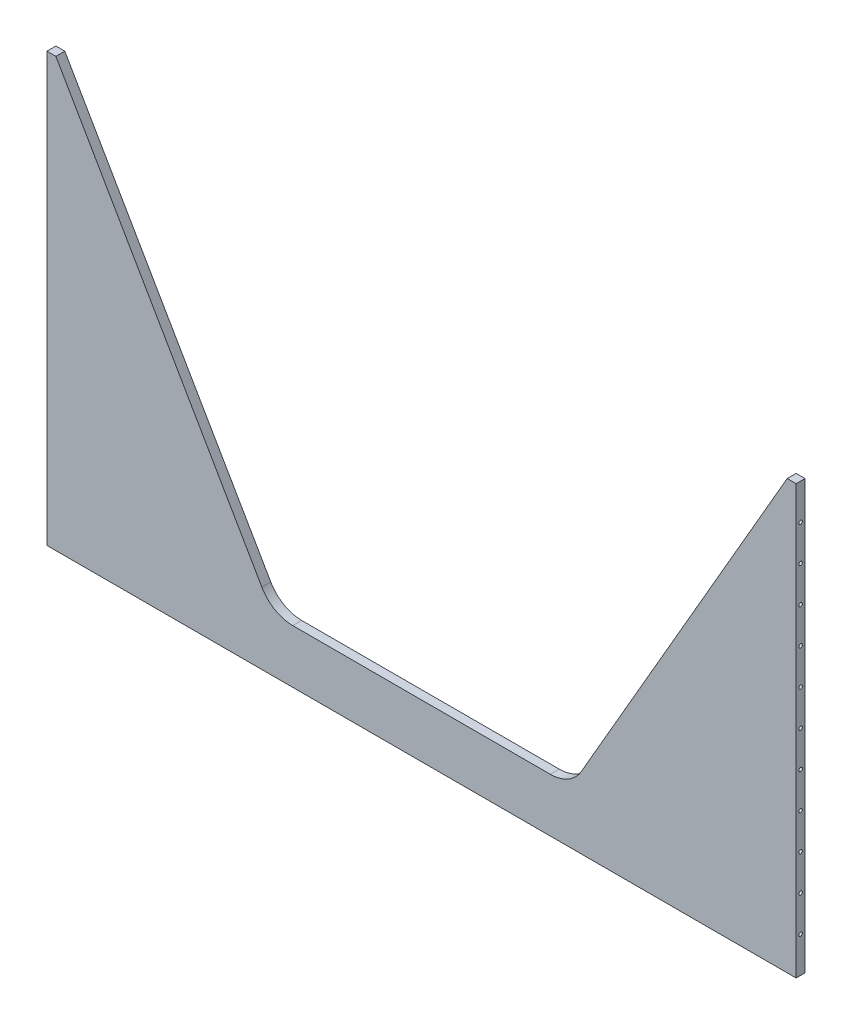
from build123d import *

# Parameters (mm, degrees)
SKETCH1_W           = 1066.8
SKETCH1_H           = 609.6
BOSS_EXTRUDE1_DEPTH = 12.7
CUT_EXTRUDE1_DEPTH  = 615.475296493
LPATTERN1_COUNT     = 11
LPATTERN1_PITCH     = 50.8
LPATTERN2_COUNT     = 20
LPATTERN2_PITCH     = 50.8


with BuildPart() as part:
    # Sketch1 → Boss-Extrude1 (new body)
    with BuildSketch(Plane.XY):
        Rectangle(SKETCH1_W, SKETCH1_H)
    extrude(amount=BOSS_EXTRUDE1_DEPTH)

    # Sketch2 → Cut-Extrude1 (cut, through all)
    with BuildSketch(Plane.XY.offset(12.7)):
        with BuildLine():
            Line((-520.7, 304.8), (-227.406063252, -203.2))
            ThreePointArc((-227.406063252, -203.2), (-208.811972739, -221.794090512), (-183.411972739, -228.6))
            Line((-183.411972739, -228.6), (183.411972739, -228.6))
            ThreePointArc((183.411972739, -228.6), (208.811972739, -221.794090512), (227.406063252, -203.2))
            Line((227.406063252, -203.2), (520.7, 304.8))
            Line((520.7, 304.8), (-520.7, 304.8))
        make_face()
    extrude(amount=-CUT_EXTRUDE1_DEPTH, mode=Mode.SUBTRACT)

    # Sketch3 → 1_4-20 Tapped Hole1 (revolve, cut)
    with BuildSketch(Plane(origin=(-533.4, -254, 6.35), x_dir=(0, 0, 1), z_dir=(0, 1, 0))):
        Polygon((0, 0), (0, 14.868816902), (2.5527, 13.335), (2.5527, 0), align=None)
    f_1_4_20_tapped_hole1 = revolve(axis=Axis((-539.75, -254, 6.35), (1, 0, 0)), mode=Mode.SUBTRACT)

    # LPattern1: 1_4-20 Tapped Hole1 ×11
    with Locations(*[(0, i * LPATTERN1_PITCH, 0) for i in range(1, LPATTERN1_COUNT)]):
        add(f_1_4_20_tapped_hole1, mode=Mode.SUBTRACT)

    # Mirror1: 1_4-20 Tapped Hole1 across plane
    add(f_1_4_20_tapped_hole1.mirror(Plane(origin=(0, 0, 0), x_dir=(0, 0, 1), z_dir=(1, 0, 0))), mode=Mode.SUBTRACT)

    # Mirror1 copy 1 sketch → Mirror1 copy 1 (revolve, cut)
    with BuildSketch(Plane(origin=(533.4, -203.2, 6.35), x_dir=(0, 0, 1), z_dir=(0, 1, 0))):
        Polygon((0, 0), (0, -14.868816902), (2.5527, -13.335), (2.5527, 0), align=None)
    revolve(axis=Axis((539.75, -203.2, 6.35), (1, 0, 0)), mode=Mode.SUBTRACT)

    # Mirror1 copy 2 sketch → Mirror1 copy 2 (revolve, cut)
    with BuildSketch(Plane(origin=(533.4, -152.4, 6.35), x_dir=(0, 0, 1), z_dir=(0, 1, 0))):
        Polygon((0, 0), (0, -14.868816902), (2.5527, -13.335), (2.5527, 0), align=None)
    revolve(axis=Axis((539.75, -152.4, 6.35), (1, 0, 0)), mode=Mode.SUBTRACT)

    # Mirror1 copy 3 sketch → Mirror1 copy 3 (revolve, cut)
    with BuildSketch(Plane(origin=(533.4, -101.6, 6.35), x_dir=(0, 0, 1), z_dir=(0, 1, 0))):
        Polygon((0, 0), (0, -14.868816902), (2.5527, -13.335), (2.5527, 0), align=None)
    revolve(axis=Axis((539.75, -101.6, 6.35), (1, 0, 0)), mode=Mode.SUBTRACT)

    # Mirror1 copy 4 sketch → Mirror1 copy 4 (revolve, cut)
    with BuildSketch(Plane(origin=(533.4, -50.8, 6.35), x_dir=(0, 0, 1), z_dir=(0, 1, 0))):
        Polygon((0, 0), (0, -14.868816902), (2.5527, -13.335), (2.5527, 0), align=None)
    revolve(axis=Axis((539.75, -50.8, 6.35), (1, 0, 0)), mode=Mode.SUBTRACT)

    # Mirror1 copy 5 sketch → Mirror1 copy 5 (revolve, cut)
    with BuildSketch(Plane(origin=(533.4, 0, 6.35), x_dir=(0, 0, 1), z_dir=(0, 1, 0))):
        Polygon((0, 0), (0, -14.868816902), (2.5527, -13.335), (2.5527, 0), align=None)
    revolve(axis=Axis((539.75, 0, 6.35), (1, 0, 0)), mode=Mode.SUBTRACT)

    # Mirror1 copy 6 sketch → Mirror1 copy 6 (revolve, cut)
    with BuildSketch(Plane(origin=(533.4, 50.8, 6.35), x_dir=(0, 0, 1), z_dir=(0, 1, 0))):
        Polygon((0, 0), (0, -14.868816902), (2.5527, -13.335), (2.5527, 0), align=None)
    revolve(axis=Axis((539.75, 50.8, 6.35), (1, 0, 0)), mode=Mode.SUBTRACT)

    # Mirror1 copy 7 sketch → Mirror1 copy 7 (revolve, cut)
    with BuildSketch(Plane(origin=(533.4, 101.6, 6.35), x_dir=(0, 0, 1), z_dir=(0, 1, 0))):
        Polygon((0, 0), (0, -14.868816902), (2.5527, -13.335), (2.5527, 0), align=None)
    revolve(axis=Axis((539.75, 101.6, 6.35), (1, 0, 0)), mode=Mode.SUBTRACT)

    # Mirror1 copy 8 sketch → Mirror1 copy 8 (revolve, cut)
    with BuildSketch(Plane(origin=(533.4, 152.4, 6.35), x_dir=(0, 0, 1), z_dir=(0, 1, 0))):
        Polygon((0, 0), (0, -14.868816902), (2.5527, -13.335), (2.5527, 0), align=None)
    revolve(axis=Axis((539.75, 152.4, 6.35), (1, 0, 0)), mode=Mode.SUBTRACT)

    # Mirror1 copy 9 sketch → Mirror1 copy 9 (revolve, cut)
    with BuildSketch(Plane(origin=(533.4, 203.2, 6.35), x_dir=(0, 0, 1), z_dir=(0, 1, 0))):
        Polygon((0, 0), (0, -14.868816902), (2.5527, -13.335), (2.5527, 0), align=None)
    revolve(axis=Axis((539.75, 203.2, 6.35), (1, 0, 0)), mode=Mode.SUBTRACT)

    # Mirror1 copy 10 sketch → Mirror1 copy 10 (revolve, cut)
    with BuildSketch(Plane(origin=(533.4, 254, 6.35), x_dir=(0, 0, 1), z_dir=(0, 1, 0))):
        Polygon((0, 0), (0, -14.868816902), (2.5527, -13.335), (2.5527, 0), align=None)
    revolve(axis=Axis((539.75, 254, 6.35), (1, 0, 0)), mode=Mode.SUBTRACT)

    # Sketch5 → 1_4-20 Tapped Hole2 (revolve, cut)
    with BuildSketch(Plane(origin=(-482.6, -304.8, 6.35), x_dir=(0, 0, -1), z_dir=(1, 0, 0))):
        Polygon((0, 0), (0, 14.868816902), (2.5527, 13.335), (2.5527, 0), align=None)
    f_1_4_20_tapped_hole2 = revolve(axis=Axis((-482.6, -311.15, 6.35), (0, 1, 0)), mode=Mode.SUBTRACT)

    # LPattern2: 1_4-20 Tapped Hole2 ×20
    with Locations(*[(i * LPATTERN2_PITCH, 0, 0) for i in range(1, LPATTERN2_COUNT)]):
        add(f_1_4_20_tapped_hole2, mode=Mode.SUBTRACT)


solid = part.part
